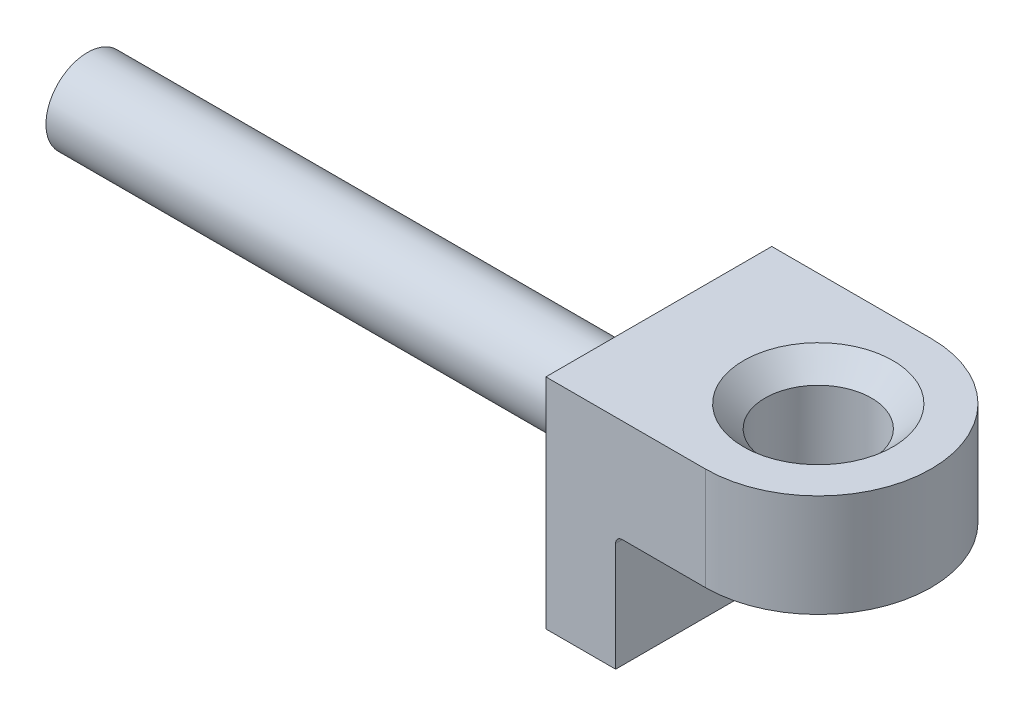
ISO-10303-21;
HEADER;
FILE_DESCRIPTION(('STEP AP214'),'2;1');
FILE_NAME('part.step','',(''),(''),'','','');
FILE_SCHEMA(('AUTOMOTIVE_DESIGN { 1 0 10303 214 1 1 1 1 }'));
ENDSEC;
DATA;
#1=APPLICATION_CONTEXT('core data for automotive mechanical design processes');
#2=APPLICATION_PROTOCOL_DEFINITION('international standard','automotive_design',2000,#1);
#3=PRODUCT_CONTEXT('',#1,'mechanical');
#4=PRODUCT('Part','Part','',(#3));
#5=PRODUCT_RELATED_PRODUCT_CATEGORY('part','',(#4));
#6=PRODUCT_DEFINITION_FORMATION('','',#4);
#7=PRODUCT_DEFINITION_CONTEXT('part definition',#1,'design');
#8=PRODUCT_DEFINITION('design','',#6,#7);
#9=PRODUCT_DEFINITION_SHAPE('','',#8);
#10=(LENGTH_UNIT() NAMED_UNIT(*) SI_UNIT(.MILLI.,.METRE.));
#11=(NAMED_UNIT(*) PLANE_ANGLE_UNIT() SI_UNIT($,.RADIAN.));
#12=(NAMED_UNIT(*) SI_UNIT($,.STERADIAN.) SOLID_ANGLE_UNIT());
#13=UNCERTAINTY_MEASURE_WITH_UNIT(LENGTH_MEASURE(1.E-05),#10,'distance_accuracy_value','');
#14=(GEOMETRIC_REPRESENTATION_CONTEXT(3) GLOBAL_UNCERTAINTY_ASSIGNED_CONTEXT((#13)) GLOBAL_UNIT_ASSIGNED_CONTEXT((#10,
#11,#12)) REPRESENTATION_CONTEXT('',''));
#15=CARTESIAN_POINT('',(0.,0.,0.));
#16=DIRECTION('',(0.,0.,1.));
#17=DIRECTION('',(1.,0.,0.));
#18=AXIS2_PLACEMENT_3D('',#15,#16,#17);
#19=CARTESIAN_POINT('',(-21.844,0.,0.));
#20=DIRECTION('',(1.,0.,0.));
#21=DIRECTION('',(0.,0.,-1.));
#22=AXIS2_PLACEMENT_3D('',#19,#20,#21);
#23=CYLINDRICAL_SURFACE('',#22,1.5875);
#24=CARTESIAN_POINT('',(-0.0508000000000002,0.,0.));
#25=DIRECTION('',(-1.,0.,0.));
#26=DIRECTION('',(0.,0.,1.));
#27=AXIS2_PLACEMENT_3D('',#24,#25,#26);
#28=CIRCLE('',#27,1.5875);
#29=CARTESIAN_POINT('',(-0.0508,0.,1.5875));
#30=VERTEX_POINT('',#29);
#31=EDGE_CURVE('E147',#30,#30,#28,.T.);
#32=ORIENTED_EDGE('',*,*,#31,.T.);
#33=EDGE_LOOP('',(#32));
#34=FACE_BOUND('',#33,.T.);
#35=CARTESIAN_POINT('',(-21.844,0.,0.));
#36=DIRECTION('',(1.,0.,0.));
#37=DIRECTION('',(0.,0.,-1.));
#38=AXIS2_PLACEMENT_3D('',#35,#36,#37);
#39=CIRCLE('',#38,1.5875);
#40=CARTESIAN_POINT('',(-21.844,0.,-1.5875));
#41=VERTEX_POINT('',#40);
#42=EDGE_CURVE('E133',#41,#41,#39,.T.);
#43=ORIENTED_EDGE('',*,*,#42,.T.);
#44=EDGE_LOOP('',(#43));
#45=FACE_BOUND('',#44,.T.);
#46=ADVANCED_FACE('F35',(#34,#45),#23,.T.);
#47=CARTESIAN_POINT('',(-21.844,0.,0.));
#48=DIRECTION('',(1.,0.,0.));
#49=DIRECTION('',(0.,0.,-1.));
#50=AXIS2_PLACEMENT_3D('',#47,#48,#49);
#51=PLANE('',#50);
#52=ORIENTED_EDGE('',*,*,#42,.F.);
#53=EDGE_LOOP('',(#52));
#54=FACE_BOUND('',#53,.T.);
#55=ADVANCED_FACE('F170',(#54),#51,.F.);
#56=CARTESIAN_POINT('',(6.096,-4.4196,0.));
#57=DIRECTION('',(0.,1.,0.));
#58=DIRECTION('',(0.,0.,1.));
#59=AXIS2_PLACEMENT_3D('',#56,#57,#58);
#60=CYLINDRICAL_SURFACE('',#59,4.318);
#61=CARTESIAN_POINT('',(6.096,0.,0.));
#62=DIRECTION('',(0.,1.,0.));
#63=DIRECTION('',(-1.,0.,0.));
#64=AXIS2_PLACEMENT_3D('',#61,#62,#63);
#65=CIRCLE('',#64,4.318);
#66=CARTESIAN_POINT('',(6.096,0.,-4.318));
#67=VERTEX_POINT('',#66);
#68=CARTESIAN_POINT('',(6.096,0.,4.318));
#69=VERTEX_POINT('',#68);
#70=EDGE_CURVE('E144',#67,#69,#65,.F.);
#71=ORIENTED_EDGE('',*,*,#70,.F.);
#72=DIRECTION('',(0.,1.,0.));
#73=VECTOR('',#72,1.);
#74=CARTESIAN_POINT('',(6.096,-4.4196,-4.318));
#75=LINE('',#74,#73);
#76=CARTESIAN_POINT('',(6.096,3.92684,-4.318));
#77=VERTEX_POINT('',#76);
#78=EDGE_CURVE('E130',#67,#77,#75,.T.);
#79=ORIENTED_EDGE('',*,*,#78,.T.);
#80=CARTESIAN_POINT('',(6.096,3.92684,0.));
#81=DIRECTION('',(0.,1.,0.));
#82=DIRECTION('',(0.,0.,1.));
#83=AXIS2_PLACEMENT_3D('',#80,#81,#82);
#84=CIRCLE('',#83,4.318);
#85=CARTESIAN_POINT('',(6.096,3.92684,4.318));
#86=VERTEX_POINT('',#85);
#87=EDGE_CURVE('E213',#86,#77,#84,.T.);
#88=ORIENTED_EDGE('',*,*,#87,.F.);
#89=DIRECTION('',(0.,1.,0.));
#90=VECTOR('',#89,1.);
#91=CARTESIAN_POINT('',(6.096,-4.4196,4.318));
#92=LINE('',#91,#90);
#93=EDGE_CURVE('E131',#69,#86,#92,.T.);
#94=ORIENTED_EDGE('',*,*,#93,.F.);
#95=EDGE_LOOP('',(#71,#79,#88,#94));
#96=FACE_BOUND('',#95,.T.);
#97=ADVANCED_FACE('F176',(#96),#60,.T.);
#98=CARTESIAN_POINT('',(0.,-4.4196,4.318));
#99=DIRECTION('',(0.,0.,1.));
#100=DIRECTION('',(1.,0.,0.));
#101=AXIS2_PLACEMENT_3D('',#98,#99,#100);
#102=PLANE('',#101);
#103=DIRECTION('',(0.,-1.,0.));
#104=VECTOR('',#103,1.);
#105=CARTESIAN_POINT('',(2.667,0.,4.318));
#106=LINE('',#105,#104);
#107=CARTESIAN_POINT('',(2.667,-0.254,4.318));
#108=VERTEX_POINT('',#107);
#109=CARTESIAN_POINT('',(2.667,-4.4196,4.318));
#110=VERTEX_POINT('',#109);
#111=EDGE_CURVE('E110',#108,#110,#106,.T.);
#112=ORIENTED_EDGE('',*,*,#111,.F.);
#113=CARTESIAN_POINT('',(2.921,-0.254,4.318));
#114=DIRECTION('',(0.,0.,1.));
#115=DIRECTION('',(1.,0.,0.));
#116=AXIS2_PLACEMENT_3D('',#113,#114,#115);
#117=CIRCLE('',#116,0.254);
#118=CARTESIAN_POINT('',(2.921,0.,4.318));
#119=VERTEX_POINT('',#118);
#120=EDGE_CURVE('E58',#108,#119,#117,.F.);
#121=ORIENTED_EDGE('',*,*,#120,.T.);
#122=DIRECTION('',(-1.,0.,0.));
#123=VECTOR('',#122,1.);
#124=CARTESIAN_POINT('',(10.414,0.,4.318));
#125=LINE('',#124,#123);
#126=EDGE_CURVE('E209',#69,#119,#125,.T.);
#127=ORIENTED_EDGE('',*,*,#126,.F.);
#128=ORIENTED_EDGE('',*,*,#93,.T.);
#129=DIRECTION('',(1.,0.,0.));
#130=VECTOR('',#129,1.);
#131=CARTESIAN_POINT('',(0.,3.92684,4.318));
#132=LINE('',#131,#130);
#133=CARTESIAN_POINT('',(0.,3.92684,4.318));
#134=VERTEX_POINT('',#133);
#135=EDGE_CURVE('E120',#134,#86,#132,.T.);
#136=ORIENTED_EDGE('',*,*,#135,.F.);
#137=DIRECTION('',(0.,1.,0.));
#138=VECTOR('',#137,1.);
#139=CARTESIAN_POINT('',(0.,-4.4196,4.318));
#140=LINE('',#139,#138);
#141=CARTESIAN_POINT('',(0.,-4.4196,4.318));
#142=VERTEX_POINT('',#141);
#143=EDGE_CURVE('E134',#142,#134,#140,.T.);
#144=ORIENTED_EDGE('',*,*,#143,.F.);
#145=DIRECTION('',(1.,0.,0.));
#146=VECTOR('',#145,1.);
#147=CARTESIAN_POINT('',(0.,-4.4196,4.318));
#148=LINE('',#147,#146);
#149=EDGE_CURVE('E122',#142,#110,#148,.T.);
#150=ORIENTED_EDGE('',*,*,#149,.T.);
#151=EDGE_LOOP('',(#112,#121,#127,#128,#136,#144,#150));
#152=FACE_BOUND('',#151,.T.);
#153=ADVANCED_FACE('F196',(#152),#102,.T.);
#154=CARTESIAN_POINT('',(0.,-4.4196,-4.318));
#155=DIRECTION('',(-1.,0.,0.));
#156=DIRECTION('',(0.,0.,1.));
#157=AXIS2_PLACEMENT_3D('',#154,#155,#156);
#158=PLANE('',#157);
#159=CARTESIAN_POINT('',(0.,0.,0.));
#160=DIRECTION('',(-1.,0.,0.));
#161=DIRECTION('',(0.,0.,1.));
#162=AXIS2_PLACEMENT_3D('',#159,#160,#161);
#163=CIRCLE('',#162,1.6383);
#164=CARTESIAN_POINT('',(0.,0.,1.6383));
#165=VERTEX_POINT('',#164);
#166=EDGE_CURVE('E141',#165,#165,#163,.F.);
#167=ORIENTED_EDGE('',*,*,#166,.T.);
#168=EDGE_LOOP('',(#167));
#169=FACE_BOUND('',#168,.T.);
#170=ORIENTED_EDGE('',*,*,#143,.T.);
#171=DIRECTION('',(0.,0.,1.));
#172=VECTOR('',#171,1.);
#173=CARTESIAN_POINT('',(0.,3.92684,-4.318));
#174=LINE('',#173,#172);
#175=CARTESIAN_POINT('',(0.,3.92684,-4.318));
#176=VERTEX_POINT('',#175);
#177=EDGE_CURVE('E125',#176,#134,#174,.T.);
#178=ORIENTED_EDGE('',*,*,#177,.F.);
#179=DIRECTION('',(0.,1.,0.));
#180=VECTOR('',#179,1.);
#181=CARTESIAN_POINT('',(0.,-4.4196,-4.318));
#182=LINE('',#181,#180);
#183=CARTESIAN_POINT('',(0.,-4.4196,-4.318));
#184=VERTEX_POINT('',#183);
#185=EDGE_CURVE('E136',#184,#176,#182,.T.);
#186=ORIENTED_EDGE('',*,*,#185,.F.);
#187=DIRECTION('',(0.,0.,1.));
#188=VECTOR('',#187,1.);
#189=CARTESIAN_POINT('',(0.,-4.4196,-4.318));
#190=LINE('',#189,#188);
#191=EDGE_CURVE('E119',#184,#142,#190,.T.);
#192=ORIENTED_EDGE('',*,*,#191,.T.);
#193=EDGE_LOOP('',(#170,#178,#186,#192));
#194=FACE_BOUND('',#193,.T.);
#195=ADVANCED_FACE('F193',(#169,#194),#158,.T.);
#196=CARTESIAN_POINT('',(6.096,-4.4196,-4.318));
#197=DIRECTION('',(0.,0.,-1.));
#198=DIRECTION('',(-1.,0.,0.));
#199=AXIS2_PLACEMENT_3D('',#196,#197,#198);
#200=PLANE('',#199);
#201=DIRECTION('',(-1.,0.,0.));
#202=VECTOR('',#201,1.);
#203=CARTESIAN_POINT('',(10.414,0.,-4.318));
#204=LINE('',#203,#202);
#205=CARTESIAN_POINT('',(2.921,0.,-4.318));
#206=VERTEX_POINT('',#205);
#207=EDGE_CURVE('E106',#67,#206,#204,.T.);
#208=ORIENTED_EDGE('',*,*,#207,.T.);
#209=CARTESIAN_POINT('',(2.921,-0.254,-4.318));
#210=DIRECTION('',(0.,0.,-1.));
#211=DIRECTION('',(-1.,0.,0.));
#212=AXIS2_PLACEMENT_3D('',#209,#210,#211);
#213=CIRCLE('',#212,0.254);
#214=CARTESIAN_POINT('',(2.667,-0.254,-4.318));
#215=VERTEX_POINT('',#214);
#216=EDGE_CURVE('E101',#206,#215,#213,.F.);
#217=ORIENTED_EDGE('',*,*,#216,.T.);
#218=DIRECTION('',(0.,-1.,0.));
#219=VECTOR('',#218,1.);
#220=CARTESIAN_POINT('',(2.667,0.,-4.318));
#221=LINE('',#220,#219);
#222=CARTESIAN_POINT('',(2.667,-4.4196,-4.318));
#223=VERTEX_POINT('',#222);
#224=EDGE_CURVE('E94',#215,#223,#221,.T.);
#225=ORIENTED_EDGE('',*,*,#224,.T.);
#226=DIRECTION('',(-1.,0.,0.));
#227=VECTOR('',#226,1.);
#228=CARTESIAN_POINT('',(6.096,-4.4196,-4.318));
#229=LINE('',#228,#227);
#230=EDGE_CURVE('E98',#223,#184,#229,.T.);
#231=ORIENTED_EDGE('',*,*,#230,.T.);
#232=ORIENTED_EDGE('',*,*,#185,.T.);
#233=DIRECTION('',(-1.,0.,0.));
#234=VECTOR('',#233,1.);
#235=CARTESIAN_POINT('',(6.096,3.92684,-4.318));
#236=LINE('',#235,#234);
#237=EDGE_CURVE('E207',#77,#176,#236,.T.);
#238=ORIENTED_EDGE('',*,*,#237,.F.);
#239=ORIENTED_EDGE('',*,*,#78,.F.);
#240=EDGE_LOOP('',(#208,#217,#225,#231,#232,#238,#239));
#241=FACE_BOUND('',#240,.T.);
#242=ADVANCED_FACE('F96',(#241),#200,.T.);
#243=CARTESIAN_POINT('',(6.096,-4.4196,0.));
#244=DIRECTION('',(0.,1.,0.));
#245=DIRECTION('',(0.,0.,1.));
#246=AXIS2_PLACEMENT_3D('',#243,#244,#245);
#247=PLANE('',#246);
#248=ORIENTED_EDGE('',*,*,#230,.F.);
#249=DIRECTION('',(0.,0.,1.));
#250=VECTOR('',#249,1.);
#251=CARTESIAN_POINT('',(2.667,-4.4196,-4.318));
#252=LINE('',#251,#250);
#253=EDGE_CURVE('E105',#223,#110,#252,.T.);
#254=ORIENTED_EDGE('',*,*,#253,.T.);
#255=ORIENTED_EDGE('',*,*,#149,.F.);
#256=ORIENTED_EDGE('',*,*,#191,.F.);
#257=EDGE_LOOP('',(#248,#254,#255,#256));
#258=FACE_BOUND('',#257,.T.);
#259=ADVANCED_FACE('F117',(#258),#247,.F.);
#260=CARTESIAN_POINT('',(6.096,-4.4196,0.));
#261=DIRECTION('',(0.,1.,0.));
#262=DIRECTION('',(0.,0.,1.));
#263=AXIS2_PLACEMENT_3D('',#260,#261,#262);
#264=CYLINDRICAL_SURFACE('',#263,2.032);
#265=CARTESIAN_POINT('',(6.096,3.10134,0.));
#266=DIRECTION('',(0.,1.,0.));
#267=DIRECTION('',(0.,0.,1.));
#268=AXIS2_PLACEMENT_3D('',#265,#266,#267);
#269=CIRCLE('',#268,2.032);
#270=CARTESIAN_POINT('',(6.096,3.10134,2.032));
#271=VERTEX_POINT('',#270);
#272=EDGE_CURVE('E43',#271,#271,#269,.T.);
#273=ORIENTED_EDGE('',*,*,#272,.T.);
#274=EDGE_LOOP('',(#273));
#275=FACE_BOUND('',#274,.T.);
#276=CARTESIAN_POINT('',(6.096,0.,0.));
#277=DIRECTION('',(0.,1.,0.));
#278=DIRECTION('',(-1.,0.,0.));
#279=AXIS2_PLACEMENT_3D('',#276,#277,#278);
#280=CIRCLE('',#279,2.032);
#281=CARTESIAN_POINT('',(4.064,0.,0.));
#282=VERTEX_POINT('',#281);
#283=EDGE_CURVE('E114',#282,#282,#280,.F.);
#284=ORIENTED_EDGE('',*,*,#283,.T.);
#285=EDGE_LOOP('',(#284));
#286=FACE_BOUND('',#285,.T.);
#287=ADVANCED_FACE('F157',(#275,#286),#264,.F.);
#288=CARTESIAN_POINT('',(6.096,3.92684,0.));
#289=DIRECTION('',(0.,1.,0.));
#290=DIRECTION('',(0.,0.,1.));
#291=AXIS2_PLACEMENT_3D('',#288,#289,#290);
#292=PLANE('',#291);
#293=CARTESIAN_POINT('',(6.096,3.92684,0.));
#294=DIRECTION('',(0.,1.,0.));
#295=DIRECTION('',(0.,0.,1.));
#296=AXIS2_PLACEMENT_3D('',#293,#294,#295);
#297=CIRCLE('',#296,2.8575);
#298=CARTESIAN_POINT('',(6.096,3.92684,2.8575));
#299=VERTEX_POINT('',#298);
#300=EDGE_CURVE('E11',#299,#299,#297,.F.);
#301=ORIENTED_EDGE('',*,*,#300,.T.);
#302=EDGE_LOOP('',(#301));
#303=FACE_BOUND('',#302,.T.);
#304=ORIENTED_EDGE('',*,*,#87,.T.);
#305=ORIENTED_EDGE('',*,*,#237,.T.);
#306=ORIENTED_EDGE('',*,*,#177,.T.);
#307=ORIENTED_EDGE('',*,*,#135,.T.);
#308=EDGE_LOOP('',(#304,#305,#306,#307));
#309=FACE_BOUND('',#308,.T.);
#310=ADVANCED_FACE('F204',(#303,#309),#292,.T.);
#311=CARTESIAN_POINT('',(10.414,0.,-4.318));
#312=DIRECTION('',(0.,1.,0.));
#313=DIRECTION('',(-1.,0.,0.));
#314=AXIS2_PLACEMENT_3D('',#311,#312,#313);
#315=PLANE('',#314);
#316=ORIENTED_EDGE('',*,*,#126,.T.);
#317=DIRECTION('',(0.,0.,1.));
#318=VECTOR('',#317,1.);
#319=CARTESIAN_POINT('',(2.921,0.,-4.318));
#320=LINE('',#319,#318);
#321=EDGE_CURVE('E50',#119,#206,#320,.F.);
#322=ORIENTED_EDGE('',*,*,#321,.T.);
#323=ORIENTED_EDGE('',*,*,#207,.F.);
#324=ORIENTED_EDGE('',*,*,#70,.T.);
#325=EDGE_LOOP('',(#316,#322,#323,#324));
#326=FACE_BOUND('',#325,.T.);
#327=ORIENTED_EDGE('',*,*,#283,.F.);
#328=EDGE_LOOP('',(#327));
#329=FACE_BOUND('',#328,.T.);
#330=ADVANCED_FACE('F187',(#326,#329),#315,.F.);
#331=CARTESIAN_POINT('',(2.667,0.,-4.318));
#332=DIRECTION('',(-1.,0.,0.));
#333=DIRECTION('',(0.,-1.,0.));
#334=AXIS2_PLACEMENT_3D('',#331,#332,#333);
#335=PLANE('',#334);
#336=ORIENTED_EDGE('',*,*,#224,.F.);
#337=DIRECTION('',(0.,0.,1.));
#338=VECTOR('',#337,1.);
#339=CARTESIAN_POINT('',(2.667,-0.254,4.318));
#340=LINE('',#339,#338);
#341=EDGE_CURVE('E150',#215,#108,#340,.T.);
#342=ORIENTED_EDGE('',*,*,#341,.T.);
#343=ORIENTED_EDGE('',*,*,#111,.T.);
#344=ORIENTED_EDGE('',*,*,#253,.F.);
#345=EDGE_LOOP('',(#336,#342,#343,#344));
#346=FACE_BOUND('',#345,.T.);
#347=ADVANCED_FACE('F109',(#346),#335,.F.);
#348=CARTESIAN_POINT('',(-0.0508000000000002,0.,0.));
#349=DIRECTION('',(-1.,0.,0.));
#350=DIRECTION('',(0.,0.,1.));
#351=AXIS2_PLACEMENT_3D('',#348,#349,#350);
#352=TOROIDAL_SURFACE('',#351,1.6383,0.0508);
#353=ORIENTED_EDGE('',*,*,#31,.F.);
#354=EDGE_LOOP('',(#353));
#355=FACE_BOUND('',#354,.T.);
#356=ORIENTED_EDGE('',*,*,#166,.F.);
#357=EDGE_LOOP('',(#356));
#358=FACE_BOUND('',#357,.T.);
#359=ADVANCED_FACE('F166',(#355,#358),#352,.F.);
#360=CARTESIAN_POINT('',(2.921,-0.254,-4.318));
#361=DIRECTION('',(0.,0.,-1.));
#362=DIRECTION('',(-1.,0.,0.));
#363=AXIS2_PLACEMENT_3D('',#360,#361,#362);
#364=CYLINDRICAL_SURFACE('',#363,0.254);
#365=ORIENTED_EDGE('',*,*,#216,.F.);
#366=ORIENTED_EDGE('',*,*,#321,.F.);
#367=ORIENTED_EDGE('',*,*,#120,.F.);
#368=ORIENTED_EDGE('',*,*,#341,.F.);
#369=EDGE_LOOP('',(#365,#366,#367,#368));
#370=FACE_BOUND('',#369,.T.);
#371=ADVANCED_FACE('F161',(#370),#364,.F.);
#372=CARTESIAN_POINT('',(6.096,3.10134,0.));
#373=DIRECTION('',(0.,1.,0.));
#374=DIRECTION('',(0.,0.,1.));
#375=AXIS2_PLACEMENT_3D('',#372,#373,#374);
#376=CONICAL_SURFACE('',#375,2.032,0.785398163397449);
#377=ORIENTED_EDGE('',*,*,#300,.F.);
#378=EDGE_LOOP('',(#377));
#379=FACE_BOUND('',#378,.T.);
#380=ORIENTED_EDGE('',*,*,#272,.F.);
#381=EDGE_LOOP('',(#380));
#382=FACE_BOUND('',#381,.T.);
#383=ADVANCED_FACE('F37',(#379,#382),#376,.F.);
#384=CLOSED_SHELL('',(#46,#55,#97,#153,#195,#242,#259,#287,#310,#330,#347,#359,#371,#383));
#385=MANIFOLD_SOLID_BREP('B2',#384);
#386=ADVANCED_BREP_SHAPE_REPRESENTATION('',(#18,#385),#14);
#387=SHAPE_DEFINITION_REPRESENTATION(#9,#386);
ENDSEC;
END-ISO-10303-21;
